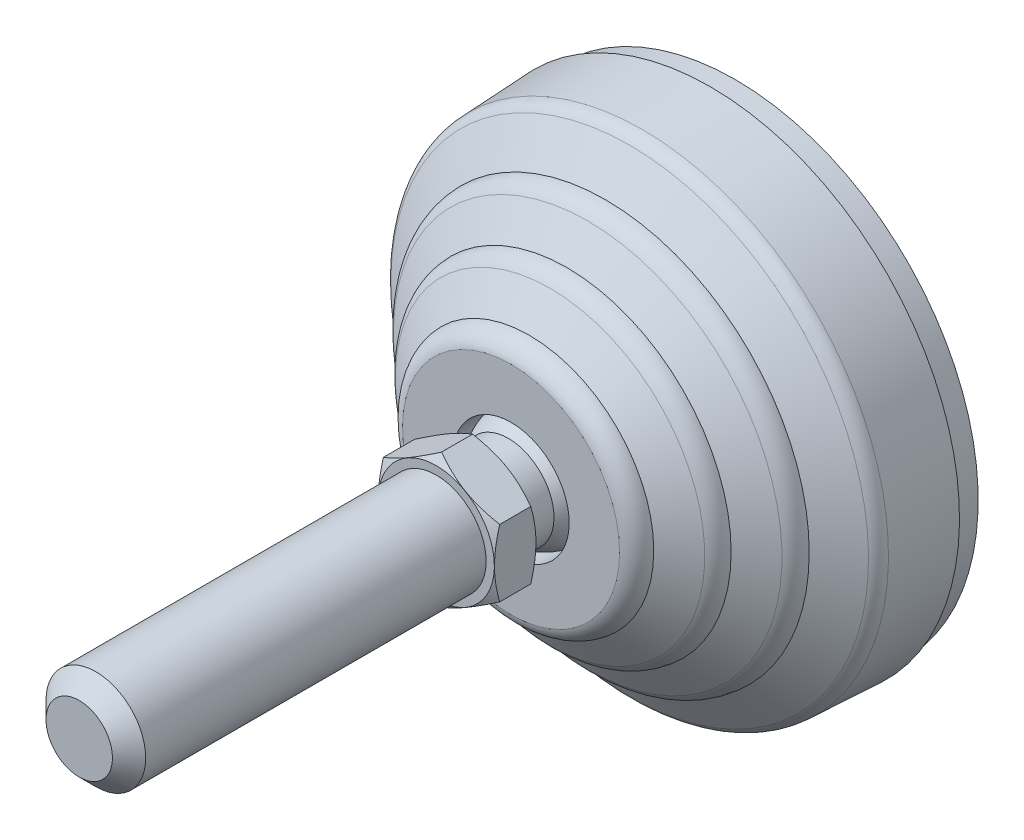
ISO-10303-21;
HEADER;
FILE_DESCRIPTION(('STEP AP214'),'2;1');
FILE_NAME('part.step','',(''),(''),'','','');
FILE_SCHEMA(('AUTOMOTIVE_DESIGN { 1 0 10303 214 1 1 1 1 }'));
ENDSEC;
DATA;
#1=APPLICATION_CONTEXT('core data for automotive mechanical design processes');
#2=APPLICATION_PROTOCOL_DEFINITION('international standard','automotive_design',2000,#1);
#3=PRODUCT_CONTEXT('',#1,'mechanical');
#4=PRODUCT('Part','Part','',(#3));
#5=PRODUCT_RELATED_PRODUCT_CATEGORY('part','',(#4));
#6=PRODUCT_DEFINITION_FORMATION('','',#4);
#7=PRODUCT_DEFINITION_CONTEXT('part definition',#1,'design');
#8=PRODUCT_DEFINITION('design','',#6,#7);
#9=PRODUCT_DEFINITION_SHAPE('','',#8);
#10=(LENGTH_UNIT() NAMED_UNIT(*) SI_UNIT(.MILLI.,.METRE.));
#11=(NAMED_UNIT(*) PLANE_ANGLE_UNIT() SI_UNIT($,.RADIAN.));
#12=(NAMED_UNIT(*) SI_UNIT($,.STERADIAN.) SOLID_ANGLE_UNIT());
#13=UNCERTAINTY_MEASURE_WITH_UNIT(LENGTH_MEASURE(1.E-05),#10,'distance_accuracy_value','');
#14=(GEOMETRIC_REPRESENTATION_CONTEXT(3) GLOBAL_UNCERTAINTY_ASSIGNED_CONTEXT((#13)) GLOBAL_UNIT_ASSIGNED_CONTEXT((#10,
#11,#12)) REPRESENTATION_CONTEXT('',''));
#15=CARTESIAN_POINT('',(0.,0.,0.));
#16=DIRECTION('',(0.,0.,1.));
#17=DIRECTION('',(1.,0.,0.));
#18=AXIS2_PLACEMENT_3D('',#15,#16,#17);
#19=CARTESIAN_POINT('',(0.,0.,35.));
#20=DIRECTION('',(0.,0.,-1.));
#21=DIRECTION('',(0.,1.,0.));
#22=AXIS2_PLACEMENT_3D('',#19,#20,#21);
#23=CYLINDRICAL_SURFACE('',#22,7.);
#24=CARTESIAN_POINT('',(-7.,0.,23.));
#25=CARTESIAN_POINT('',(-7.00000242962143,-0.114537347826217,23.));
#26=CARTESIAN_POINT('',(-6.99718891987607,-0.229074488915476,23.));
#27=CARTESIAN_POINT('',(-6.98594746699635,-0.45787295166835,23.));
#28=CARTESIAN_POINT('',(-6.97751952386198,-0.572134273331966,23.));
#29=CARTESIAN_POINT('',(-6.95506664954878,-0.800105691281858,23.));
#30=CARTESIAN_POINT('',(-6.94104171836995,-0.913815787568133,23.));
#31=CARTESIAN_POINT('',(-6.90742942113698,-1.14041085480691,23.));
#32=CARTESIAN_POINT('',(-6.88784205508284,-1.25329582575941,23.));
#33=CARTESIAN_POINT('',(-6.84315187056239,-1.47796868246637,23.));
#34=CARTESIAN_POINT('',(-6.81804905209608,-1.58975656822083,23.));
#35=CARTESIAN_POINT('',(-6.76238849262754,-1.81196595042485,23.));
#36=CARTESIAN_POINT('',(-6.73183075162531,-1.9223874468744,23.));
#37=CARTESIAN_POINT('',(-6.66533394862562,-2.14159803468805,23.));
#38=CARTESIAN_POINT('',(-6.62939488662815,-2.25038712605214,23.));
#39=CARTESIAN_POINT('',(-6.55222202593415,-2.46607082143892,23.));
#40=CARTESIAN_POINT('',(-6.51098822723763,-2.5729654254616,23.));
#41=CARTESIAN_POINT('',(-6.42332522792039,-2.78460262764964,23.));
#42=CARTESIAN_POINT('',(-6.37689602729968,-2.88934522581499,23.));
#43=CARTESIAN_POINT('',(-6.27895407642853,-3.09642608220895,23.));
#44=CARTESIAN_POINT('',(-6.22744132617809,-3.19876434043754,23.));
#45=CARTESIAN_POINT('',(-6.11945637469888,-3.40078997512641,23.));
#46=CARTESIAN_POINT('',(-6.06298417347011,-3.50047735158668,23.));
#47=CARTESIAN_POINT('',(-5.94521636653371,-3.69696106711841,23.));
#48=CARTESIAN_POINT('',(-5.88392076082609,-3.79375740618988,23.));
#49=CARTESIAN_POINT('',(-5.75665381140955,-3.98422585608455,23.));
#50=CARTESIAN_POINT('',(-5.69068246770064,-4.07789796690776,23.));
#51=CARTESIAN_POINT('',(-5.55422297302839,-4.26189229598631,23.));
#52=CARTESIAN_POINT('',(-5.48373482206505,-4.35221451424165,23.));
#53=CARTESIAN_POINT('',(-5.33841152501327,-4.52929146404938,23.));
#54=CARTESIAN_POINT('',(-5.26357637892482,-4.61604619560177,23.));
#55=CARTESIAN_POINT('',(-5.10973937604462,-4.78577917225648,23.));
#56=CARTESIAN_POINT('',(-5.03073751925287,-4.8687574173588,23.));
#57=CARTESIAN_POINT('',(-4.8687574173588,-5.03073751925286,23.));
#58=CARTESIAN_POINT('',(-4.78577917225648,-5.10973937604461,23.));
#59=CARTESIAN_POINT('',(-4.61604619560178,-5.26357637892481,23.));
#60=CARTESIAN_POINT('',(-4.52929146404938,-5.33841152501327,23.));
#61=CARTESIAN_POINT('',(-4.35221451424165,-5.48373482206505,23.));
#62=CARTESIAN_POINT('',(-4.26189229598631,-5.55422297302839,23.));
#63=CARTESIAN_POINT('',(-4.07789796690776,-5.69068246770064,23.));
#64=CARTESIAN_POINT('',(-3.98422585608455,-5.75665381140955,23.));
#65=CARTESIAN_POINT('',(-3.79375740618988,-5.88392076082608,23.));
#66=CARTESIAN_POINT('',(-3.69696106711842,-5.9452163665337,23.));
#67=CARTESIAN_POINT('',(-3.50047735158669,-6.0629841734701,23.));
#68=CARTESIAN_POINT('',(-3.40078997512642,-6.11945637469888,23.));
#69=CARTESIAN_POINT('',(-3.19876434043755,-6.22744132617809,23.));
#70=CARTESIAN_POINT('',(-3.09642608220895,-6.27895407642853,23.));
#71=CARTESIAN_POINT('',(-2.88934522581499,-6.37689602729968,23.));
#72=CARTESIAN_POINT('',(-2.78460262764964,-6.42332522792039,23.));
#73=CARTESIAN_POINT('',(-2.57296542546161,-6.51098822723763,23.));
#74=CARTESIAN_POINT('',(-2.46607082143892,-6.55222202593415,23.));
#75=CARTESIAN_POINT('',(-2.25038712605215,-6.62939488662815,23.));
#76=CARTESIAN_POINT('',(-2.14159803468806,-6.66533394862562,23.));
#77=CARTESIAN_POINT('',(-1.92238744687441,-6.73183075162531,23.));
#78=CARTESIAN_POINT('',(-1.81196595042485,-6.76238849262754,23.));
#79=CARTESIAN_POINT('',(-1.58975656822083,-6.81804905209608,23.));
#80=CARTESIAN_POINT('',(-1.47796868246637,-6.84315187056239,23.));
#81=CARTESIAN_POINT('',(-1.25329582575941,-6.88784205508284,23.));
#82=CARTESIAN_POINT('',(-1.14041085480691,-6.90742942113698,23.));
#83=CARTESIAN_POINT('',(-0.913815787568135,-6.94104171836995,23.));
#84=CARTESIAN_POINT('',(-0.80010569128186,-6.95506664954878,23.));
#85=CARTESIAN_POINT('',(-0.572134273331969,-6.97751952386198,23.));
#86=CARTESIAN_POINT('',(-0.457872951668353,-6.98594746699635,23.));
#87=CARTESIAN_POINT('',(-0.229074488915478,-6.99718891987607,23.));
#88=CARTESIAN_POINT('',(-0.11453734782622,-7.00000242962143,23.));
#89=CARTESIAN_POINT('',(0.,-7.,23.));
#90=B_SPLINE_CURVE_WITH_KNOTS('',3,(#24,#25,#26,#27,#28,#29,#30,#31,#32,#33,#34,#35,#36,#37,#38,
#39,#40,#41,#42,#43,#44,#45,#46,#47,#48,#49,#50,#51,#52,#53,#54,#55,#56,#57,#58,#59,#60,#61,#62,
#63,#64,#65,#66,#67,#68,#69,#70,#71,#72,#73,#74,#75,#76,#77,#78,#79,#80,#81,#82,#83,#84,#85,#86,
#87,#88,#89),.UNSPECIFIED.,.F.,.F.,(4,2,2,2,2,2,2,2,2,2,2,2,2,2,2,2,2,2,2,2,2,2,2,2,2,2,2,2,2,2,
2,2,4),(0.,0.343577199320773,0.687154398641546,1.03073159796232,1.37430879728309,
1.71788599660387,2.06146319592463,2.40504039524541,2.74861759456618,3.09219479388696,
3.43577199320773,3.7793491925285,4.12292639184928,4.46650359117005,4.81008079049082,
5.15365798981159,5.49723518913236,5.84081238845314,6.18438958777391,6.52796678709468,
6.87154398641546,7.21512118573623,7.558698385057,7.90227558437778,8.24585278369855,
8.58942998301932,8.93300718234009,9.27658438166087,9.62016158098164,9.96373878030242,
10.3073159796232,10.650893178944,10.9944703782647),.UNSPECIFIED.);
#91=CARTESIAN_POINT('',(-7.,0.,23.0001794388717));
#92=VERTEX_POINT('',#91);
#93=CARTESIAN_POINT('',(0.,-7.,23.));
#94=VERTEX_POINT('',#93);
#95=EDGE_CURVE('E138',#92,#94,#90,.T.);
#96=ORIENTED_EDGE('',*,*,#95,.F.);
#97=CARTESIAN_POINT('',(0.,0.,23.));
#98=DIRECTION('',(0.,0.,-1.));
#99=DIRECTION('',(0.,1.,0.));
#100=AXIS2_PLACEMENT_3D('',#97,#98,#99);
#101=CIRCLE('',#100,7.);
#102=CARTESIAN_POINT('',(0.,7.,23.));
#103=VERTEX_POINT('',#102);
#104=EDGE_CURVE('E134',#103,#92,#101,.F.);
#105=ORIENTED_EDGE('',*,*,#104,.F.);
#106=CARTESIAN_POINT('',(7.,0.,23.));
#107=CARTESIAN_POINT('',(7.00000242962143,0.114537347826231,22.9999999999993));
#108=CARTESIAN_POINT('',(6.99718891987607,0.22907448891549,22.9999999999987));
#109=CARTESIAN_POINT('',(6.98594746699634,0.457872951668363,22.9999999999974));
#110=CARTESIAN_POINT('',(6.97751952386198,0.572134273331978,22.9999999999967));
#111=CARTESIAN_POINT('',(6.95506664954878,0.800105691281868,22.9999999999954));
#112=CARTESIAN_POINT('',(6.94104171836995,0.913815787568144,22.9999999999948));
#113=CARTESIAN_POINT('',(6.90742942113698,1.14041085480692,22.9999999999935));
#114=CARTESIAN_POINT('',(6.88784205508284,1.25329582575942,22.9999999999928));
#115=CARTESIAN_POINT('',(6.84315187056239,1.47796868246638,22.9999999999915));
#116=CARTESIAN_POINT('',(6.81804905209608,1.58975656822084,22.9999999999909));
#117=CARTESIAN_POINT('',(6.76238849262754,1.81196595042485,22.9999999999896));
#118=CARTESIAN_POINT('',(6.73183075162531,1.92238744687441,22.999999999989));
#119=CARTESIAN_POINT('',(6.66533394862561,2.14159803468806,22.9999999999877));
#120=CARTESIAN_POINT('',(6.62939488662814,2.25038712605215,22.9999999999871));
#121=CARTESIAN_POINT('',(6.55222202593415,2.46607082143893,22.9999999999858));
#122=CARTESIAN_POINT('',(6.51098822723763,2.57296542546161,22.9999999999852));
#123=CARTESIAN_POINT('',(6.42332522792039,2.78460262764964,22.999999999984));
#124=CARTESIAN_POINT('',(6.37689602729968,2.88934522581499,22.9999999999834));
#125=CARTESIAN_POINT('',(6.27895407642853,3.09642608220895,22.9999999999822));
#126=CARTESIAN_POINT('',(6.22744132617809,3.19876434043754,22.9999999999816));
#127=CARTESIAN_POINT('',(6.11945637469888,3.40078997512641,22.9999999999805));
#128=CARTESIAN_POINT('',(6.06298417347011,3.50047735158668,22.9999999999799));
#129=CARTESIAN_POINT('',(5.94521636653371,3.69696106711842,22.9999999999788));
#130=CARTESIAN_POINT('',(5.88392076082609,3.79375740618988,22.9999999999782));
#131=CARTESIAN_POINT('',(5.75665381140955,3.98422585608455,22.9999999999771));
#132=CARTESIAN_POINT('',(5.69068246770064,4.07789796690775,22.9999999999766));
#133=CARTESIAN_POINT('',(5.55422297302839,4.26189229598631,22.9999999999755));
#134=CARTESIAN_POINT('',(5.48373482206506,4.35221451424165,22.999999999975));
#135=CARTESIAN_POINT('',(5.33841152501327,4.52929146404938,22.999999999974));
#136=CARTESIAN_POINT('',(5.26357637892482,4.61604619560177,22.9999999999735));
#137=CARTESIAN_POINT('',(5.10973937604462,4.78577917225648,22.9999999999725));
#138=CARTESIAN_POINT('',(5.03073751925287,4.8687574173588,22.9999999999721));
#139=CARTESIAN_POINT('',(4.8687574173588,5.03073751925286,22.9999999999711));
#140=CARTESIAN_POINT('',(4.78577917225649,5.10973937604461,22.9999999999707));
#141=CARTESIAN_POINT('',(4.61604619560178,5.26357637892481,22.9999999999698));
#142=CARTESIAN_POINT('',(4.52929146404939,5.33841152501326,22.9999999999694));
#143=CARTESIAN_POINT('',(4.35221451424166,5.48373482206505,22.9999999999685));
#144=CARTESIAN_POINT('',(4.26189229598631,5.55422297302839,22.9999999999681));
#145=CARTESIAN_POINT('',(4.07789796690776,5.69068246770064,22.9999999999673));
#146=CARTESIAN_POINT('',(3.98422585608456,5.75665381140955,22.999999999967));
#147=CARTESIAN_POINT('',(3.79375740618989,5.88392076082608,22.9999999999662));
#148=CARTESIAN_POINT('',(3.69696106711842,5.9452163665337,22.9999999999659));
#149=CARTESIAN_POINT('',(3.50047735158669,6.0629841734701,22.9999999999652));
#150=CARTESIAN_POINT('',(3.40078997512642,6.11945637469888,22.9999999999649));
#151=CARTESIAN_POINT('',(3.19876434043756,6.22744132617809,22.9999999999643));
#152=CARTESIAN_POINT('',(3.09642608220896,6.27895407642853,22.999999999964));
#153=CARTESIAN_POINT('',(2.88934522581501,6.37689602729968,22.9999999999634));
#154=CARTESIAN_POINT('',(2.78460262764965,6.42332522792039,22.9999999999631));
#155=CARTESIAN_POINT('',(2.57296542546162,6.51098822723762,22.9999999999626));
#156=CARTESIAN_POINT('',(2.46607082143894,6.55222202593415,22.9999999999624));
#157=CARTESIAN_POINT('',(2.25038712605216,6.62939488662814,22.999999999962));
#158=CARTESIAN_POINT('',(2.14159803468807,6.66533394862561,22.9999999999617));
#159=CARTESIAN_POINT('',(1.92238744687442,6.73183075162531,22.9999999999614));
#160=CARTESIAN_POINT('',(1.81196595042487,6.76238849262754,22.9999999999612));
#161=CARTESIAN_POINT('',(1.58975656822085,6.81804905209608,22.9999999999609));
#162=CARTESIAN_POINT('',(1.47796868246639,6.84315187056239,22.9999999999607));
#163=CARTESIAN_POINT('',(1.25329582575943,6.88784205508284,22.9999999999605));
#164=CARTESIAN_POINT('',(1.14041085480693,6.90742942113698,22.9999999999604));
#165=CARTESIAN_POINT('',(0.913815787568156,6.94104171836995,22.9999999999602));
#166=CARTESIAN_POINT('',(0.80010569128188,6.95506664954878,22.9999999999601));
#167=CARTESIAN_POINT('',(0.572134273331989,6.97751952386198,22.9999999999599));
#168=CARTESIAN_POINT('',(0.457872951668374,6.98594746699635,22.9999999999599));
#169=CARTESIAN_POINT('',(0.229074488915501,6.99718891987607,22.9999999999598));
#170=CARTESIAN_POINT('',(0.114537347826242,7.00000242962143,22.9999999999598));
#171=CARTESIAN_POINT('',(0.,7.,22.9999999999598));
#172=B_SPLINE_CURVE_WITH_KNOTS('',3,(#106,#107,#108,#109,#110,#111,#112,#113,#114,#115,#116,
#117,#118,#119,#120,#121,#122,#123,#124,#125,#126,#127,#128,#129,#130,#131,#132,#133,#134,#135,
#136,#137,#138,#139,#140,#141,#142,#143,#144,#145,#146,#147,#148,#149,#150,#151,#152,#153,#154,
#155,#156,#157,#158,#159,#160,#161,#162,#163,#164,#165,#166,#167,#168,#169,#170,#171),
.UNSPECIFIED.,.F.,.F.,(4,2,2,2,2,2,2,2,2,2,2,2,2,2,2,2,2,2,2,2,2,2,2,2,2,2,2,2,2,2,2,2,4),(0.,
0.343577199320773,0.687154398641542,1.03073159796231,1.37430879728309,1.71788599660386,
2.06146319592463,2.4050403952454,2.74861759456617,3.09219479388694,3.43577199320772,
3.77934919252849,4.12292639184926,4.46650359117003,4.8100807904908,5.15365798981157,
5.49723518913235,5.84081238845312,6.18438958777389,6.52796678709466,6.87154398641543,
7.21512118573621,7.55869838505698,7.90227558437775,8.24585278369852,8.58942998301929,
8.93300718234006,9.27658438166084,9.62016158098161,9.96373878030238,10.3073159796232,
10.6508931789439,10.9944703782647),.UNSPECIFIED.);
#173=CARTESIAN_POINT('',(7.,0.,23.));
#174=VERTEX_POINT('',#173);
#175=EDGE_CURVE('E31',#174,#103,#172,.T.);
#176=ORIENTED_EDGE('',*,*,#175,.F.);
#177=CARTESIAN_POINT('',(0.,0.,23.));
#178=DIRECTION('',(0.,0.,-1.));
#179=DIRECTION('',(0.,1.,0.));
#180=AXIS2_PLACEMENT_3D('',#177,#178,#179);
#181=CIRCLE('',#180,7.);
#182=EDGE_CURVE('E135',#94,#174,#181,.F.);
#183=ORIENTED_EDGE('',*,*,#182,.F.);
#184=EDGE_LOOP('',(#96,#105,#176,#183));
#185=FACE_BOUND('',#184,.T.);
#186=CARTESIAN_POINT('',(0.,0.,27.));
#187=DIRECTION('',(0.,0.,-1.));
#188=DIRECTION('',(0.,1.,0.));
#189=AXIS2_PLACEMENT_3D('',#186,#187,#188);
#190=CIRCLE('',#189,7.);
#191=CARTESIAN_POINT('',(0.,7.,27.));
#192=VERTEX_POINT('',#191);
#193=EDGE_CURVE('E161',#192,#192,#190,.T.);
#194=ORIENTED_EDGE('',*,*,#193,.F.);
#195=EDGE_LOOP('',(#194));
#196=FACE_BOUND('',#195,.T.);
#197=ADVANCED_FACE('F14',(#185,#196),#23,.F.);
#198=CARTESIAN_POINT('',(-6.53226682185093,0.,27.));
#199=DIRECTION('',(0.,0.,1.));
#200=DIRECTION('',(-1.,0.,0.));
#201=AXIS2_PLACEMENT_3D('',#198,#199,#200);
#202=PLANE('',#201);
#203=CARTESIAN_POINT('',(0.,0.,27.));
#204=DIRECTION('',(0.,0.,-1.));
#205=DIRECTION('',(0.,1.,0.));
#206=AXIS2_PLACEMENT_3D('',#203,#204,#205);
#207=CIRCLE('',#206,13.0645336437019);
#208=CARTESIAN_POINT('',(0.,13.0645336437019,27.));
#209=VERTEX_POINT('',#208);
#210=EDGE_CURVE('E157',#209,#209,#207,.T.);
#211=ORIENTED_EDGE('',*,*,#210,.F.);
#212=EDGE_LOOP('',(#211));
#213=FACE_BOUND('',#212,.T.);
#214=ORIENTED_EDGE('',*,*,#193,.T.);
#215=EDGE_LOOP('',(#214));
#216=FACE_BOUND('',#215,.T.);
#217=ADVANCED_FACE('F311',(#213,#216),#202,.T.);
#218=CARTESIAN_POINT('',(0.,0.,24.5842));
#219=DIRECTION('',(0.,0.,-1.));
#220=DIRECTION('',(0.,1.,0.));
#221=AXIS2_PLACEMENT_3D('',#218,#219,#220);
#222=TOROIDAL_SURFACE('',#221,12.5253,2.47525);
#223=ORIENTED_EDGE('',*,*,#210,.T.);
#224=EDGE_LOOP('',(#223));
#225=FACE_BOUND('',#224,.T.);
#226=CARTESIAN_POINT('',(0.,0.,24.8062186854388));
#227=DIRECTION('',(0.,0.,-1.));
#228=DIRECTION('',(-1.,0.,0.));
#229=AXIS2_PLACEMENT_3D('',#226,#227,#228);
#230=CIRCLE('',#229,14.9905728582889);
#231=CARTESIAN_POINT('',(-14.9905728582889,0.,24.8062186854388));
#232=VERTEX_POINT('',#231);
#233=EDGE_CURVE('E160',#232,#232,#230,.T.);
#234=ORIENTED_EDGE('',*,*,#233,.F.);
#235=EDGE_LOOP('',(#234));
#236=FACE_BOUND('',#235,.T.);
#237=ADVANCED_FACE('F499',(#225,#236),#222,.T.);
#238=CARTESIAN_POINT('',(0.,0.,22.3004110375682));
#239=DIRECTION('',(0.,0.,-1.));
#240=DIRECTION('',(0.,1.,0.));
#241=AXIS2_PLACEMENT_3D('',#238,#239,#240);
#242=CONICAL_SURFACE('',#241,18.63040749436,0.967870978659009);
#243=ORIENTED_EDGE('',*,*,#233,.T.);
#244=EDGE_LOOP('',(#243));
#245=FACE_BOUND('',#244,.T.);
#246=CARTESIAN_POINT('',(0.,0.,22.3004110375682));
#247=DIRECTION('',(0.,0.,-1.));
#248=DIRECTION('',(0.,1.,0.));
#249=AXIS2_PLACEMENT_3D('',#246,#247,#248);
#250=CIRCLE('',#249,18.63040749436);
#251=CARTESIAN_POINT('',(0.,18.63040749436,22.3004110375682));
#252=VERTEX_POINT('',#251);
#253=EDGE_CURVE('E556',#252,#252,#250,.T.);
#254=ORIENTED_EDGE('',*,*,#253,.F.);
#255=EDGE_LOOP('',(#254));
#256=FACE_BOUND('',#255,.T.);
#257=ADVANCED_FACE('F489',(#245,#256),#242,.T.);
#258=CARTESIAN_POINT('',(0.,0.,20.149417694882));
#259=DIRECTION('',(0.,0.,-1.));
#260=DIRECTION('',(0.,1.,0.));
#261=AXIS2_PLACEMENT_3D('',#258,#259,#260);
#262=TOROIDAL_SURFACE('',#261,17.1699621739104,2.59993709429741);
#263=CARTESIAN_POINT('',(0.,0.,20.266146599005));
#264=DIRECTION('',(0.,0.,-1.));
#265=DIRECTION('',(-1.,0.,0.));
#266=AXIS2_PLACEMENT_3D('',#263,#264,#265);
#267=CIRCLE('',#266,19.7672775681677);
#268=CARTESIAN_POINT('',(-19.7672775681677,0.,20.266146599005));
#269=VERTEX_POINT('',#268);
#270=EDGE_CURVE('E559',#269,#269,#267,.T.);
#271=ORIENTED_EDGE('',*,*,#270,.F.);
#272=EDGE_LOOP('',(#271));
#273=FACE_BOUND('',#272,.T.);
#274=ORIENTED_EDGE('',*,*,#253,.T.);
#275=EDGE_LOOP('',(#274));
#276=FACE_BOUND('',#275,.T.);
#277=ADVANCED_FACE('F479',(#273,#276),#262,.T.);
#278=CARTESIAN_POINT('',(0.,0.,17.7704000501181));
#279=DIRECTION('',(0.,0.,-1.));
#280=DIRECTION('',(0.,1.,0.));
#281=AXIS2_PLACEMENT_3D('',#278,#279,#280);
#282=CONICAL_SURFACE('',#281,23.3925000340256,0.967871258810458);
#283=CARTESIAN_POINT('',(0.,0.,17.7704000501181));
#284=DIRECTION('',(0.,0.,-1.));
#285=DIRECTION('',(0.,1.,0.));
#286=AXIS2_PLACEMENT_3D('',#283,#284,#285);
#287=CIRCLE('',#286,23.3925000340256);
#288=CARTESIAN_POINT('',(0.,23.3925000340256,17.7704000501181));
#289=VERTEX_POINT('',#288);
#290=EDGE_CURVE('E567',#289,#289,#287,.T.);
#291=ORIENTED_EDGE('',*,*,#290,.F.);
#292=EDGE_LOOP('',(#291));
#293=FACE_BOUND('',#292,.T.);
#294=ORIENTED_EDGE('',*,*,#270,.T.);
#295=EDGE_LOOP('',(#294));
#296=FACE_BOUND('',#295,.T.);
#297=ADVANCED_FACE('F469',(#293,#296),#282,.T.);
#298=CARTESIAN_POINT('',(0.,0.,15.6193000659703));
#299=DIRECTION('',(0.,0.,-1.));
#300=DIRECTION('',(0.,1.,0.));
#301=AXIS2_PLACEMENT_3D('',#298,#299,#300);
#302=TOROIDAL_SURFACE('',#301,21.9321002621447,2.59999973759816);
#303=ORIENTED_EDGE('',*,*,#290,.T.);
#304=EDGE_LOOP('',(#303));
#305=FACE_BOUND('',#304,.T.);
#306=CARTESIAN_POINT('',(0.,0.,15.6295138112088));
#307=DIRECTION('',(0.,0.,-1.));
#308=DIRECTION('',(-1.,0.,0.));
#309=AXIS2_PLACEMENT_3D('',#306,#307,#308);
#310=CIRCLE('',#309,24.5320799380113);
#311=CARTESIAN_POINT('',(-24.5320799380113,0.,15.6295138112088));
#312=VERTEX_POINT('',#311);
#313=EDGE_CURVE('E573',#312,#312,#310,.T.);
#314=ORIENTED_EDGE('',*,*,#313,.F.);
#315=EDGE_LOOP('',(#314));
#316=FACE_BOUND('',#315,.T.);
#317=ADVANCED_FACE('F459',(#305,#316),#302,.T.);
#318=CARTESIAN_POINT('',(0.,0.,12.7183562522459));
#319=DIRECTION('',(0.,0.,-1.));
#320=DIRECTION('',(0.,1.,0.));
#321=AXIS2_PLACEMENT_3D('',#318,#319,#320);
#322=CONICAL_SURFACE('',#321,28.760790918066,0.967879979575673);
#323=ORIENTED_EDGE('',*,*,#313,.T.);
#324=EDGE_LOOP('',(#323));
#325=FACE_BOUND('',#324,.T.);
#326=CARTESIAN_POINT('',(0.,0.,12.7183562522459));
#327=DIRECTION('',(0.,0.,-1.));
#328=DIRECTION('',(0.,1.,0.));
#329=AXIS2_PLACEMENT_3D('',#326,#327,#328);
#330=CIRCLE('',#329,28.760790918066);
#331=CARTESIAN_POINT('',(0.,28.760790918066,12.7183562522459));
#332=VERTEX_POINT('',#331);
#333=EDGE_CURVE('E576',#332,#332,#330,.T.);
#334=ORIENTED_EDGE('',*,*,#333,.F.);
#335=EDGE_LOOP('',(#334));
#336=FACE_BOUND('',#335,.T.);
#337=ADVANCED_FACE('F449',(#325,#336),#322,.T.);
#338=CARTESIAN_POINT('',(0.,0.,11.0710969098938));
#339=DIRECTION('',(0.,0.,-1.));
#340=DIRECTION('',(0.,1.,0.));
#341=AXIS2_PLACEMENT_3D('',#338,#339,#340);
#342=TOROIDAL_SURFACE('',#341,27.6268354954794,1.9998295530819);
#343=CARTESIAN_POINT('',(0.,0.,11.1756615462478));
#344=DIRECTION('',(0.,0.,-1.));
#345=DIRECTION('',(-1.,0.,0.));
#346=AXIS2_PLACEMENT_3D('',#343,#344,#345);
#347=CIRCLE('',#346,29.6239295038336);
#348=CARTESIAN_POINT('',(-29.6239295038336,0.,11.1756615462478));
#349=VERTEX_POINT('',#348);
#350=EDGE_CURVE('E156',#349,#349,#347,.T.);
#351=ORIENTED_EDGE('',*,*,#350,.F.);
#352=EDGE_LOOP('',(#351));
#353=FACE_BOUND('',#352,.T.);
#354=ORIENTED_EDGE('',*,*,#333,.T.);
#355=EDGE_LOOP('',(#354));
#356=FACE_BOUND('',#355,.T.);
#357=ADVANCED_FACE('F439',(#353,#356),#342,.T.);
#358=CARTESIAN_POINT('',(0.,0.,3.00000000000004));
#359=DIRECTION('',(0.,0.,-1.));
#360=DIRECTION('',(0.,1.,0.));
#361=AXIS2_PLACEMENT_3D('',#358,#359,#360);
#362=CONICAL_SURFACE('',#361,30.,0.0459663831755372);
#363=CARTESIAN_POINT('',(0.,0.,3.));
#364=DIRECTION('',(0.,0.,-1.));
#365=DIRECTION('',(0.,1.,0.));
#366=AXIS2_PLACEMENT_3D('',#363,#364,#365);
#367=CIRCLE('',#366,30.);
#368=CARTESIAN_POINT('',(0.,30.,3.));
#369=VERTEX_POINT('',#368);
#370=EDGE_CURVE('E153',#369,#369,#367,.T.);
#371=ORIENTED_EDGE('',*,*,#370,.F.);
#372=EDGE_LOOP('',(#371));
#373=FACE_BOUND('',#372,.T.);
#374=ORIENTED_EDGE('',*,*,#350,.T.);
#375=EDGE_LOOP('',(#374));
#376=FACE_BOUND('',#375,.T.);
#377=ADVANCED_FACE('F429',(#373,#376),#362,.T.);
#378=CARTESIAN_POINT('',(-29.625,0.,3.));
#379=DIRECTION('',(0.,0.,-1.));
#380=DIRECTION('',(0.,1.,0.));
#381=AXIS2_PLACEMENT_3D('',#378,#379,#380);
#382=PLANE('',#381);
#383=ORIENTED_EDGE('',*,*,#370,.T.);
#384=EDGE_LOOP('',(#383));
#385=FACE_BOUND('',#384,.T.);
#386=CARTESIAN_POINT('',(0.,0.,3.));
#387=DIRECTION('',(0.,0.,1.));
#388=DIRECTION('',(0.,-1.,0.));
#389=AXIS2_PLACEMENT_3D('',#386,#387,#388);
#390=CIRCLE('',#389,29.25);
#391=CARTESIAN_POINT('',(0.,-29.25,3.));
#392=VERTEX_POINT('',#391);
#393=EDGE_CURVE('E150',#392,#392,#390,.F.);
#394=ORIENTED_EDGE('',*,*,#393,.F.);
#395=EDGE_LOOP('',(#394));
#396=FACE_BOUND('',#395,.T.);
#397=ADVANCED_FACE('F418',(#385,#396),#382,.T.);
#398=CARTESIAN_POINT('',(0.,0.,1.5));
#399=DIRECTION('',(0.,0.,1.));
#400=DIRECTION('',(0.,-1.,0.));
#401=AXIS2_PLACEMENT_3D('',#398,#399,#400);
#402=CYLINDRICAL_SURFACE('',#401,29.25);
#403=CARTESIAN_POINT('',(0.,0.,0.));
#404=DIRECTION('',(0.,0.,1.));
#405=DIRECTION('',(0.,-1.,0.));
#406=AXIS2_PLACEMENT_3D('',#403,#404,#405);
#407=CIRCLE('',#406,29.25);
#408=CARTESIAN_POINT('',(0.,-29.25,0.));
#409=VERTEX_POINT('',#408);
#410=EDGE_CURVE('E147',#409,#409,#407,.F.);
#411=ORIENTED_EDGE('',*,*,#410,.F.);
#412=EDGE_LOOP('',(#411));
#413=FACE_BOUND('',#412,.T.);
#414=ORIENTED_EDGE('',*,*,#393,.T.);
#415=EDGE_LOOP('',(#414));
#416=FACE_BOUND('',#415,.T.);
#417=ADVANCED_FACE('F303',(#413,#416),#402,.T.);
#418=CARTESIAN_POINT('',(-14.625,0.,0.));
#419=DIRECTION('',(0.,0.,-1.));
#420=DIRECTION('',(0.,1.,0.));
#421=AXIS2_PLACEMENT_3D('',#418,#419,#420);
#422=PLANE('',#421);
#423=ORIENTED_EDGE('',*,*,#410,.T.);
#424=EDGE_LOOP('',(#423));
#425=FACE_BOUND('',#424,.T.);
#426=ADVANCED_FACE('F117',(#425),#422,.T.);
#427=CARTESIAN_POINT('',(0.,0.,56.4265));
#428=DIRECTION('',(0.,0.,-1.));
#429=DIRECTION('',(0.,1.,0.));
#430=AXIS2_PLACEMENT_3D('',#427,#428,#429);
#431=CYLINDRICAL_SURFACE('',#430,6.);
#432=CARTESIAN_POINT('',(0.,0.,77.));
#433=DIRECTION('',(0.,0.,1.));
#434=DIRECTION('',(0.,-1.,0.));
#435=AXIS2_PLACEMENT_3D('',#432,#433,#434);
#436=CIRCLE('',#435,6.);
#437=CARTESIAN_POINT('',(0.,-6.,77.));
#438=VERTEX_POINT('',#437);
#439=EDGE_CURVE('E9',#438,#438,#436,.F.);
#440=ORIENTED_EDGE('',*,*,#439,.T.);
#441=EDGE_LOOP('',(#440));
#442=FACE_BOUND('',#441,.T.);
#443=CARTESIAN_POINT('',(0.,0.,36.));
#444=DIRECTION('',(0.,0.,-1.));
#445=DIRECTION('',(0.,1.,0.));
#446=AXIS2_PLACEMENT_3D('',#443,#444,#445);
#447=CIRCLE('',#446,6.);
#448=CARTESIAN_POINT('',(0.,6.,36.));
#449=VERTEX_POINT('',#448);
#450=EDGE_CURVE('E136',#449,#449,#447,.F.);
#451=ORIENTED_EDGE('',*,*,#450,.T.);
#452=EDGE_LOOP('',(#451));
#453=FACE_BOUND('',#452,.T.);
#454=ADVANCED_FACE('F293',(#442,#453),#431,.T.);
#455=CARTESIAN_POINT('',(6.495,0.,36.));
#456=DIRECTION('',(0.,0.,1.));
#457=DIRECTION('',(0.,-1.,0.));
#458=AXIS2_PLACEMENT_3D('',#455,#456,#457);
#459=PLANE('',#458);
#460=CARTESIAN_POINT('',(0.,0.,36.));
#461=DIRECTION('',(0.,0.,-1.));
#462=DIRECTION('',(0.,1.,0.));
#463=AXIS2_PLACEMENT_3D('',#460,#461,#462);
#464=CIRCLE('',#463,6.99);
#465=CARTESIAN_POINT('',(0.,6.99,36.));
#466=VERTEX_POINT('',#465);
#467=EDGE_CURVE('E607',#466,#466,#464,.F.);
#468=ORIENTED_EDGE('',*,*,#467,.T.);
#469=EDGE_LOOP('',(#468));
#470=FACE_BOUND('',#469,.T.);
#471=ORIENTED_EDGE('',*,*,#450,.F.);
#472=EDGE_LOOP('',(#471));
#473=FACE_BOUND('',#472,.T.);
#474=ADVANCED_FACE('F260',(#470,#473),#459,.T.);
#475=CARTESIAN_POINT('',(0.,0.,35.3652257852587));
#476=DIRECTION('',(0.,0.,-1.));
#477=DIRECTION('',(0.,1.,0.));
#478=AXIS2_PLACEMENT_3D('',#475,#476,#477);
#479=CONICAL_SURFACE('',#478,8.08946119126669,1.0471975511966);
#480=ORIENTED_EDGE('',*,*,#467,.F.);
#481=EDGE_LOOP('',(#480));
#482=FACE_BOUND('',#481,.T.);
#483=CARTESIAN_POINT('',(-2.30772558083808E-08,8.0829037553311,35.3690117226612));
#484=CARTESIAN_POINT('',(-0.153866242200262,7.99406905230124,35.4202905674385));
#485=CARTESIAN_POINT('',(-0.30830614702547,7.90490313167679,35.4692419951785));
#486=CARTESIAN_POINT('',(-0.618440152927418,7.72584717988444,35.5618490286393));
#487=CARTESIAN_POINT('',(-0.774134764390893,7.63595685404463,35.6055023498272));
#488=CARTESIAN_POINT('',(-1.24371128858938,7.3648467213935,35.7276582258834));
#489=CARTESIAN_POINT('',(-1.55944671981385,7.18255678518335,35.7971380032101));
#490=CARTESIAN_POINT('',(-2.03193900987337,6.90976323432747,35.878609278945));
#491=CARTESIAN_POINT('',(-2.18728424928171,6.82007461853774,35.9018177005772));
#492=CARTESIAN_POINT('',(-2.49867655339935,6.64029218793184,35.9407339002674));
#493=CARTESIAN_POINT('',(-2.65472355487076,6.55019840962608,35.9564423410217));
#494=CARTESIAN_POINT('',(-2.96708848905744,6.369854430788,35.9799582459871));
#495=CARTESIAN_POINT('',(-3.1234059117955,6.27960452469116,35.98777467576));
#496=CARTESIAN_POINT('',(-3.43617641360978,6.09902639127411,35.9953473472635));
#497=CARTESIAN_POINT('',(-3.59262948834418,6.00869816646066,35.9951038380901));
#498=CARTESIAN_POINT('',(-4.02123302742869,5.76124379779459,35.9833586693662));
#499=CARTESIAN_POINT('',(-4.29324310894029,5.60419870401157,35.9636515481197));
#500=CARTESIAN_POINT('',(-4.83545665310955,5.2911515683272,35.9011668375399));
#501=CARTESIAN_POINT('',(-5.10565820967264,5.13515062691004,35.8583679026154));
#502=CARTESIAN_POINT('',(-5.64896246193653,4.82147377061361,35.7513856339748));
#503=CARTESIAN_POINT('',(-5.92199662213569,4.66383742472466,35.6867491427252));
#504=CARTESIAN_POINT('',(-6.46399382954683,4.35091519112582,35.5400514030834));
#505=CARTESIAN_POINT('',(-6.73296381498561,4.19562529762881,35.4580246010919));
#506=CARTESIAN_POINT('',(-6.99999992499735,4.04145192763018,35.3690117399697));
#507=B_SPLINE_CURVE_WITH_KNOTS('',3,(#483,#484,#485,#486,#487,#488,#489,#490,#491,#492,#493,
#494,#495,#496,#497,#498,#499,#500,#501,#502,#503,#504,#505,#506),.UNSPECIFIED.,.F.,.F.,(4,2,2,
2,2,2,2,2,2,2,2,4),(0.,0.554720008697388,1.10967836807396,2.22190068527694,2.76439120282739,
3.30683377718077,3.8486594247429,4.39046832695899,5.33360242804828,6.27760984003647,
7.24255081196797,8.20559801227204),.UNSPECIFIED.);
#508=CARTESIAN_POINT('',(-1.15386261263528E-08,8.08290376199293,35.369011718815));
#509=VERTEX_POINT('',#508);
#510=CARTESIAN_POINT('',(-7.,4.04145190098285,35.3690117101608));
#511=VERTEX_POINT('',#510);
#512=EDGE_CURVE('E100',#509,#511,#507,.T.);
#513=ORIENTED_EDGE('',*,*,#512,.T.);
#514=CARTESIAN_POINT('',(-7.,4.04145191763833,35.3690117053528));
#515=CARTESIAN_POINT('',(-7.,3.70968878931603,35.4647934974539));
#516=CARTESIAN_POINT('',(-7.,3.37530112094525,35.5524844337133));
#517=CARTESIAN_POINT('',(-7.,2.70109388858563,35.7074672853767));
#518=CARTESIAN_POINT('',(-7.,2.36126392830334,35.7747135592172));
#519=CARTESIAN_POINT('',(-7.,1.68541720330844,35.882853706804));
#520=CARTESIAN_POINT('',(-7.,1.34949559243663,35.9243241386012));
#521=CARTESIAN_POINT('',(-7.,0.675714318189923,35.9799957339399));
#522=CARTESIAN_POINT('',(-7.,0.337857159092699,35.9942264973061));
#523=CARTESIAN_POINT('',(-7.,-0.337857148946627,35.9942264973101));
#524=CARTESIAN_POINT('',(-7.,-0.67571429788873,35.9799957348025));
#525=CARTESIAN_POINT('',(-7.,-1.34949555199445,35.9243241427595));
#526=CARTESIAN_POINT('',(-7.,-1.68541715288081,35.8828537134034));
#527=CARTESIAN_POINT('',(-7.,-2.3612638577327,35.7747135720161));
#528=CARTESIAN_POINT('',(-7.,-2.70109380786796,35.7074673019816));
#529=CARTESIAN_POINT('',(-7.,-3.37530102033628,35.5524844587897));
#530=CARTESIAN_POINT('',(-7.,-3.70968867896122,35.4647935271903));
#531=CARTESIAN_POINT('',(-7.,-4.04145179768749,35.3690117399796));
#532=B_SPLINE_CURVE_WITH_KNOTS('',3,(#514,#515,#516,#517,#518,#519,#520,#521,#522,#523,#524,
#525,#526,#527,#528,#529,#530,#531),.UNSPECIFIED.,.F.,.F.,(4,2,2,2,2,2,2,2,4),(0.,
1.03625689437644,2.07481046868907,3.08920803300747,4.10250268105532,5.11579729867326,
6.1301948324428,7.16874837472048,8.2050052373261),.UNSPECIFIED.);
#533=CARTESIAN_POINT('',(-7.00000001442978,-4.04145187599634,35.3690117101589));
#534=VERTEX_POINT('',#533);
#535=EDGE_CURVE('E274',#511,#534,#532,.T.);
#536=ORIENTED_EDGE('',*,*,#535,.T.);
#537=CARTESIAN_POINT('',(-7.00000002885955,-4.04145186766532,35.369011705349));
#538=CARTESIAN_POINT('',(-6.84613380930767,-4.13028657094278,35.4202905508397));
#539=CARTESIAN_POINT('',(-6.6916939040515,-4.21945249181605,35.4692419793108));
#540=CARTESIAN_POINT('',(-6.38155989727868,-4.39850844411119,35.5618490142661));
#541=CARTESIAN_POINT('',(-6.22586528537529,-4.48839877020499,35.6055023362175));
#542=CARTESIAN_POINT('',(-5.7562887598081,-4.75950890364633,35.7276582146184));
#543=CARTESIAN_POINT('',(-5.4405533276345,-4.94179884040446,35.7971379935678));
#544=CARTESIAN_POINT('',(-4.96806103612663,-5.21459239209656,35.8786092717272));
#545=CARTESIAN_POINT('',(-4.8127157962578,-5.30428100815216,35.9018176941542));
#546=CARTESIAN_POINT('',(-4.50132349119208,-5.48406343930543,35.9407338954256));
#547=CARTESIAN_POINT('',(-4.34527648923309,-5.57415721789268,35.9564423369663));
#548=CARTESIAN_POINT('',(-4.03291155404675,-5.75450119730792,35.9799582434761));
#549=CARTESIAN_POINT('',(-3.87659413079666,-5.84475110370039,35.9877746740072));
#550=CARTESIAN_POINT('',(-3.56382362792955,-6.02532923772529,35.9953473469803));
#551=CARTESIAN_POINT('',(-3.40737055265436,-6.11565746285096,35.9951038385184));
#552=CARTESIAN_POINT('',(-2.97876700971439,-6.36311183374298,35.9833586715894));
#553=CARTESIAN_POINT('',(-2.70675692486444,-6.52015692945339,35.9636515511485));
#554=CARTESIAN_POINT('',(-2.16454337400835,-6.83320406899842,35.9011668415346));
#555=CARTESIAN_POINT('',(-1.89434181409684,-6.98920501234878,35.8583679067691));
#556=CARTESIAN_POINT('',(-1.35103755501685,-7.30288187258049,35.7513856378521));
#557=CARTESIAN_POINT('',(-1.0780033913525,-7.46051822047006,35.6867491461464));
#558=CARTESIAN_POINT('',(-0.536006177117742,-7.77344045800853,35.5400514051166));
#559=CARTESIAN_POINT('',(-0.267036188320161,-7.92873035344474,35.4580246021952));
#560=CARTESIAN_POINT('',(-7.50026377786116E-08,-8.08290372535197,35.3690117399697));
#561=B_SPLINE_CURVE_WITH_KNOTS('',3,(#537,#538,#539,#540,#541,#542,#543,#544,#545,#546,#547,
#548,#549,#550,#551,#552,#553,#554,#555,#556,#557,#558,#559,#560),.UNSPECIFIED.,.F.,.F.,(4,2,2,
2,2,2,2,2,2,2,2,4),(0.,0.55472001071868,1.10967837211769,2.22190069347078,2.76439121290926,
3.30683378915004,3.84865943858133,4.39046834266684,5.33360245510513,6.27760987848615,
7.24255086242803,8.20559807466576),.UNSPECIFIED.);
#562=CARTESIAN_POINT('',(-1.44240629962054E-08,-8.0829037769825,35.3690117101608));
#563=VERTEX_POINT('',#562);
#564=EDGE_CURVE('E245',#534,#563,#561,.T.);
#565=ORIENTED_EDGE('',*,*,#564,.T.);
#566=CARTESIAN_POINT('',(-2.884812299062E-08,-8.08290378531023,35.3690117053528));
#567=CARTESIAN_POINT('',(0.153866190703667,-7.99406908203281,35.4202905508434));
#568=CARTESIAN_POINT('',(0.308306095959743,-7.9049031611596,35.4692419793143));
#569=CARTESIAN_POINT('',(0.618440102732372,-7.72584720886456,35.5618490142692));
#570=CARTESIAN_POINT('',(0.774134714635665,-7.63595688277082,35.6055023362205));
#571=CARTESIAN_POINT('',(1.24371124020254,-7.36484674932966,35.7276582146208));
#572=CARTESIAN_POINT('',(1.55944667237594,-7.18255681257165,35.79713799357));
#573=CARTESIAN_POINT('',(2.03193896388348,-6.90976326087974,35.8786092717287));
#574=CARTESIAN_POINT('',(2.18728420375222,-6.8200746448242,35.9018176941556));
#575=CARTESIAN_POINT('',(2.49867650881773,-6.64029221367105,35.9407338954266));
#576=CARTESIAN_POINT('',(2.65472351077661,-6.55019843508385,35.9564423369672));
#577=CARTESIAN_POINT('',(2.96708844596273,-6.36985445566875,35.9799582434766));
#578=CARTESIAN_POINT('',(3.12340586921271,-6.27960454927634,35.9877746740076));
#579=CARTESIAN_POINT('',(3.43617637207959,-6.09902641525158,35.9953473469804));
#580=CARTESIAN_POINT('',(3.59262944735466,-6.00869819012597,35.9951038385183));
#581=CARTESIAN_POINT('',(4.02123299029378,-5.76124381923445,35.9833586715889));
#582=CARTESIAN_POINT('',(4.29324307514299,-5.60419872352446,35.9636515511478));
#583=CARTESIAN_POINT('',(4.8354566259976,-5.29115158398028,35.9011668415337));
#584=CARTESIAN_POINT('',(5.10565818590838,-5.13515064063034,35.8583679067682));
#585=CARTESIAN_POINT('',(5.64896244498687,-4.8214737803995,35.7513856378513));
#586=CARTESIAN_POINT('',(5.92199660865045,-4.66383743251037,35.6867491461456));
#587=CARTESIAN_POINT('',(6.46399382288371,-4.35091519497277,35.5400514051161));
#588=CARTESIAN_POINT('',(6.73296381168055,-4.19562529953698,35.4580246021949));
#589=CARTESIAN_POINT('',(6.99999992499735,-4.04145192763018,35.3690117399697));
#590=B_SPLINE_CURVE_WITH_KNOTS('',3,(#566,#567,#568,#569,#570,#571,#572,#573,#574,#575,#576,
#577,#578,#579,#580,#581,#582,#583,#584,#585,#586,#587,#588,#589),.UNSPECIFIED.,.F.,.F.,(4,2,2,
2,2,2,2,2,2,2,2,4),(0.,0.554720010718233,1.1096783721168,2.22190069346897,2.76439121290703,
3.30683378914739,3.84865943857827,4.39046834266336,5.33360245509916,6.27760987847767,
7.24255086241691,8.20559807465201),.UNSPECIFIED.);
#591=CARTESIAN_POINT('',(7.,-4.04145190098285,35.3690117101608));
#592=VERTEX_POINT('',#591);
#593=EDGE_CURVE('E236',#563,#592,#590,.T.);
#594=ORIENTED_EDGE('',*,*,#593,.T.);
#595=CARTESIAN_POINT('',(7.,-4.04145191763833,35.3690117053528));
#596=CARTESIAN_POINT('',(7.,-3.70968878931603,35.4647934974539));
#597=CARTESIAN_POINT('',(7.,-3.37530112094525,35.5524844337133));
#598=CARTESIAN_POINT('',(7.,-2.70109388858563,35.7074672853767));
#599=CARTESIAN_POINT('',(7.,-2.36126392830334,35.7747135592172));
#600=CARTESIAN_POINT('',(7.,-1.68541720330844,35.882853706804));
#601=CARTESIAN_POINT('',(7.,-1.34949559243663,35.9243241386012));
#602=CARTESIAN_POINT('',(7.,-0.675714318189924,35.9799957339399));
#603=CARTESIAN_POINT('',(7.,-0.3378571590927,35.9942264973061));
#604=CARTESIAN_POINT('',(7.,0.337857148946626,35.9942264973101));
#605=CARTESIAN_POINT('',(7.,0.675714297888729,35.9799957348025));
#606=CARTESIAN_POINT('',(7.,1.34949555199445,35.9243241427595));
#607=CARTESIAN_POINT('',(7.,1.68541715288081,35.8828537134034));
#608=CARTESIAN_POINT('',(7.,2.3612638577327,35.7747135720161));
#609=CARTESIAN_POINT('',(7.,2.70109380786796,35.7074673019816));
#610=CARTESIAN_POINT('',(7.,3.37530102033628,35.5524844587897));
#611=CARTESIAN_POINT('',(7.,3.70968867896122,35.4647935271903));
#612=CARTESIAN_POINT('',(7.,4.04145179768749,35.3690117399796));
#613=B_SPLINE_CURVE_WITH_KNOTS('',3,(#595,#596,#597,#598,#599,#600,#601,#602,#603,#604,#605,
#606,#607,#608,#609,#610,#611,#612),.UNSPECIFIED.,.F.,.F.,(4,2,2,2,2,2,2,2,4),(0.,
1.03625689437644,2.07481046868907,3.08920803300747,4.10250268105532,5.11579729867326,
6.13019483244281,7.16874837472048,8.2050052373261),.UNSPECIFIED.);
#614=CARTESIAN_POINT('',(7.00000001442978,4.04145187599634,35.3690117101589));
#615=VERTEX_POINT('',#614);
#616=EDGE_CURVE('E244',#592,#615,#613,.T.);
#617=ORIENTED_EDGE('',*,*,#616,.T.);
#618=CARTESIAN_POINT('',(7.00000002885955,4.04145186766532,35.369011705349));
#619=CARTESIAN_POINT('',(6.84613380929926,4.13028657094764,35.4202905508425));
#620=CARTESIAN_POINT('',(6.69169390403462,4.2194524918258,35.4692419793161));
#621=CARTESIAN_POINT('',(6.3815598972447,4.39850844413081,35.5618490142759));
#622=CARTESIAN_POINT('',(6.2258652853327,4.48839877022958,35.6055023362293));
#623=CARTESIAN_POINT('',(5.75628875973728,4.75950890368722,35.7276582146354));
#624=CARTESIAN_POINT('',(5.44055332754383,4.94179884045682,35.797137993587));
#625=CARTESIAN_POINT('',(4.96806103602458,5.21459239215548,35.8786092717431));
#626=CARTESIAN_POINT('',(4.81271579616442,5.30428100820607,35.9018176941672));
#627=CARTESIAN_POINT('',(4.50132349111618,5.48406343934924,35.9407338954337));
#628=CARTESIAN_POINT('',(4.345276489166,5.57415721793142,35.9564423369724));
#629=CARTESIAN_POINT('',(4.0329115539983,5.75450119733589,35.9799582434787));
#630=CARTESIAN_POINT('',(3.87659413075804,5.84475110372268,35.9877746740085));
#631=CARTESIAN_POINT('',(3.56382362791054,6.02532923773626,35.9953473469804));
#632=CARTESIAN_POINT('',(3.40737055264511,6.1156574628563,35.9951038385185));
#633=CARTESIAN_POINT('',(2.97876700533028,6.36311183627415,35.9833586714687));
#634=CARTESIAN_POINT('',(2.70675691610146,6.5201569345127,35.9636515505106));
#635=CARTESIAN_POINT('',(2.16454335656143,6.8332040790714,35.9011668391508));
#636=CARTESIAN_POINT('',(1.89434179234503,6.9892050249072,35.8583679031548));
#637=CARTESIAN_POINT('',(1.35103752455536,7.30288189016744,35.7513856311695));
#638=CARTESIAN_POINT('',(1.07800335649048,7.46051824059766,35.6867491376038));
#639=CARTESIAN_POINT('',(0.536006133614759,7.77344048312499,35.5400513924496));
#640=CARTESIAN_POINT('',(0.267036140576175,7.92873038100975,35.4580245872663));
#641=CARTESIAN_POINT('',(2.30772582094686E-08,8.0829037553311,35.3690117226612));
#642=B_SPLINE_CURVE_WITH_KNOTS('',3,(#618,#619,#620,#621,#622,#623,#624,#625,#626,#627,#628,
#629,#630,#631,#632,#633,#634,#635,#636,#637,#638,#639,#640,#641),.UNSPECIFIED.,.F.,.F.,(4,2,2,
2,2,2,2,2,2,2,2,4),(0.,0.554720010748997,1.10967837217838,2.22190069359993,2.7643912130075,
3.30683378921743,3.84865943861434,4.3904683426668,5.33360247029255,6.2776099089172,
7.24255090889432,8.20559813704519),.UNSPECIFIED.);
#643=EDGE_CURVE('E265',#615,#509,#642,.T.);
#644=ORIENTED_EDGE('',*,*,#643,.T.);
#645=EDGE_LOOP('',(#513,#536,#565,#594,#617,#644));
#646=FACE_BOUND('',#645,.T.);
#647=ADVANCED_FACE('F256',(#482,#646),#479,.T.);
#648=CARTESIAN_POINT('',(0.,-8.08290376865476,36.1));
#649=DIRECTION('',(0.5,0.866025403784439,0.));
#650=DIRECTION('',(-0.866025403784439,0.5,0.));
#651=AXIS2_PLACEMENT_3D('',#648,#649,#650);
#652=PLANE('',#651);
#653=DIRECTION('',(0.,0.,1.));
#654=VECTOR('',#653,1.);
#655=CARTESIAN_POINT('',(0.,-8.08290376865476,36.1));
#656=LINE('',#655,#654);
#657=CARTESIAN_POINT('',(0.,-8.08290376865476,31.6309882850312));
#658=VERTEX_POINT('',#657);
#659=EDGE_CURVE('E169',#658,#563,#656,.T.);
#660=ORIENTED_EDGE('',*,*,#659,.T.);
#661=ORIENTED_EDGE('',*,*,#564,.F.);
#662=DIRECTION('',(0.,0.,1.));
#663=VECTOR('',#662,1.);
#664=CARTESIAN_POINT('',(-7.,-4.04145188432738,36.1));
#665=LINE('',#664,#663);
#666=CARTESIAN_POINT('',(-7.,-4.04145188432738,31.6309882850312));
#667=VERTEX_POINT('',#666);
#668=EDGE_CURVE('E171',#667,#534,#665,.T.);
#669=ORIENTED_EDGE('',*,*,#668,.F.);
#670=CARTESIAN_POINT('',(0.,-8.08290376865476,31.6309882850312));
#671=CARTESIAN_POINT('',(-0.153866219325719,-7.99406906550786,31.5797094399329));
#672=CARTESIAN_POINT('',(-0.308306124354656,-7.90490314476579,31.5307580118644));
#673=CARTESIAN_POINT('',(-0.618440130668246,-7.72584719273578,31.4381509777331));
#674=CARTESIAN_POINT('',(-0.774134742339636,-7.63595686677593,31.3944976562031));
#675=CARTESIAN_POINT('',(-1.24371126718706,-7.36484673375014,31.2723417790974));
#676=CARTESIAN_POINT('',(-1.55944669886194,-7.18255679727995,31.2028620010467));
#677=CARTESIAN_POINT('',(-2.03193898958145,-6.90976324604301,31.1213907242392));
#678=CARTESIAN_POINT('',(-2.18728422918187,-6.82007463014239,31.098182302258));
#679=CARTESIAN_POINT('',(-2.49867653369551,-6.64029219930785,31.0592661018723));
#680=CARTESIAN_POINT('',(-2.65472353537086,-6.55019842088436,31.0435576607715));
#681=CARTESIAN_POINT('',(-2.96708846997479,-6.36985444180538,31.0200417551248));
#682=CARTESIAN_POINT('',(-3.12340589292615,-6.27960453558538,31.012225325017));
#683=CARTESIAN_POINT('',(-3.43617639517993,-6.09902640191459,31.0046526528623));
#684=CARTESIAN_POINT('',(-3.59262947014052,-6.00869817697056,31.0048961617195));
#685=CARTESIAN_POINT('',(-4.02123301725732,-5.76124380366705,31.0166413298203));
#686=CARTESIAN_POINT('',(-4.29324310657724,-5.60419870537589,31.0363484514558));
#687=CARTESIAN_POINT('',(-4.83545666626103,-5.29115156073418,31.0988331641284));
#688=CARTESIAN_POINT('',(-5.10565823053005,-5.135150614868,31.1416321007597));
#689=CARTESIAN_POINT('',(-5.64896249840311,-4.82147374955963,31.248614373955));
#690=CARTESIAN_POINT('',(-5.92199666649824,-4.66383739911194,31.3132508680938));
#691=CARTESIAN_POINT('',(-6.46399388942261,-4.35091515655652,31.4599486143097));
#692=CARTESIAN_POINT('',(-6.73296388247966,-4.1956252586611,31.5419754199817));
#693=CARTESIAN_POINT('',(-7.,-4.04145188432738,31.6309882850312));
#694=B_SPLINE_CURVE_WITH_KNOTS('',3,(#670,#671,#672,#673,#674,#675,#676,#677,#678,#679,#680,
#681,#682,#683,#684,#685,#686,#687,#688,#689,#690,#691,#692,#693),.UNSPECIFIED.,.F.,.F.,(4,2,2,
2,2,2,2,2,2,2,2,4),(0.,0.554720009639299,1.10967836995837,2.22190068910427,2.76439120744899,
3.30683378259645,3.84865943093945,4.39046833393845,5.3336024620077,6.2776099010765,
7.24255090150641,8.20559813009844),.UNSPECIFIED.);
#695=EDGE_CURVE('E170',#658,#667,#694,.T.);
#696=ORIENTED_EDGE('',*,*,#695,.F.);
#697=EDGE_LOOP('',(#660,#661,#669,#696));
#698=FACE_BOUND('',#697,.T.);
#699=ADVANCED_FACE('F228',(#698),#652,.F.);
#700=CARTESIAN_POINT('',(7.,-4.04145188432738,36.1));
#701=DIRECTION('',(-0.5,0.866025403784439,0.));
#702=DIRECTION('',(-0.866025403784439,-0.5,0.));
#703=AXIS2_PLACEMENT_3D('',#700,#701,#702);
#704=PLANE('',#703);
#705=DIRECTION('',(0.,0.,1.));
#706=VECTOR('',#705,1.);
#707=CARTESIAN_POINT('',(7.,-4.04145188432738,36.1));
#708=LINE('',#707,#706);
#709=CARTESIAN_POINT('',(7.,-4.04145188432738,31.6309882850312));
#710=VERTEX_POINT('',#709);
#711=EDGE_CURVE('E166',#710,#592,#708,.T.);
#712=ORIENTED_EDGE('',*,*,#711,.T.);
#713=ORIENTED_EDGE('',*,*,#593,.F.);
#714=ORIENTED_EDGE('',*,*,#659,.F.);
#715=CARTESIAN_POINT('',(7.,-4.04145188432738,31.6309882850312));
#716=CARTESIAN_POINT('',(6.84613378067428,-4.13028658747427,31.5797094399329));
#717=CARTESIAN_POINT('',(6.69169387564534,-4.21945250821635,31.5307580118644));
#718=CARTESIAN_POINT('',(6.38155986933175,-4.39850846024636,31.4381509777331));
#719=CARTESIAN_POINT('',(6.22586525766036,-4.48839878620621,31.3944976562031));
#720=CARTESIAN_POINT('',(5.75628873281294,-4.759508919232,31.2723417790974));
#721=CARTESIAN_POINT('',(5.44055330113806,-4.94179885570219,31.2028620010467));
#722=CARTESIAN_POINT('',(4.96806101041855,-5.21459240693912,31.1213907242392));
#723=CARTESIAN_POINT('',(4.81271577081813,-5.30428102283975,31.098182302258));
#724=CARTESIAN_POINT('',(4.50132346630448,-5.48406345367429,31.0592661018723));
#725=CARTESIAN_POINT('',(4.34527646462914,-5.57415723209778,31.0435576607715));
#726=CARTESIAN_POINT('',(4.0329115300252,-5.75450121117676,31.0200417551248));
#727=CARTESIAN_POINT('',(3.87659410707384,-5.84475111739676,31.012225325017));
#728=CARTESIAN_POINT('',(3.56382360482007,-6.02532925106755,31.0046526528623));
#729=CARTESIAN_POINT('',(3.40737052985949,-6.11565747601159,31.0048961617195));
#730=CARTESIAN_POINT('',(2.97876698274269,-6.36311184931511,31.0166413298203));
#731=CARTESIAN_POINT('',(2.70675689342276,-6.52015694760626,31.0363484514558));
#732=CARTESIAN_POINT('',(2.16454333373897,-6.83320409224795,31.0988331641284));
#733=CARTESIAN_POINT('',(1.89434176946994,-6.98920503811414,31.1416321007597));
#734=CARTESIAN_POINT('',(1.35103750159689,-7.30288190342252,31.248614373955));
#735=CARTESIAN_POINT('',(1.07800333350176,-7.4605182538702,31.3132508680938));
#736=CARTESIAN_POINT('',(0.536006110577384,-7.77344049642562,31.4599486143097));
#737=CARTESIAN_POINT('',(0.26703611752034,-7.92873039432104,31.5419754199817));
#738=CARTESIAN_POINT('',(0.,-8.08290376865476,31.6309882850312));
#739=B_SPLINE_CURVE_WITH_KNOTS('',3,(#715,#716,#717,#718,#719,#720,#721,#722,#723,#724,#725,
#726,#727,#728,#729,#730,#731,#732,#733,#734,#735,#736,#737,#738),.UNSPECIFIED.,.F.,.F.,(4,2,2,
2,2,2,2,2,2,2,2,4),(0.,0.554720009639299,1.10967836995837,2.22190068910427,2.76439120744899,
3.30683378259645,3.84865943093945,4.39046833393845,5.3336024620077,6.2776099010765,
7.24255090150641,8.20559813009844),.UNSPECIFIED.);
#740=EDGE_CURVE('E168',#710,#658,#739,.T.);
#741=ORIENTED_EDGE('',*,*,#740,.F.);
#742=EDGE_LOOP('',(#712,#713,#714,#741));
#743=FACE_BOUND('',#742,.T.);
#744=ADVANCED_FACE('F225',(#743),#704,.F.);
#745=CARTESIAN_POINT('',(-7.,4.04145188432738,36.1));
#746=DIRECTION('',(0.5,-0.866025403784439,0.));
#747=DIRECTION('',(0.866025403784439,0.5,0.));
#748=AXIS2_PLACEMENT_3D('',#745,#746,#747);
#749=PLANE('',#748);
#750=DIRECTION('',(0.,0.,1.));
#751=VECTOR('',#750,1.);
#752=CARTESIAN_POINT('',(-7.,4.04145188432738,36.1));
#753=LINE('',#752,#751);
#754=CARTESIAN_POINT('',(-7.,4.04145188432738,31.6309882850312));
#755=VERTEX_POINT('',#754);
#756=EDGE_CURVE('E96',#755,#511,#753,.T.);
#757=ORIENTED_EDGE('',*,*,#756,.T.);
#758=ORIENTED_EDGE('',*,*,#512,.F.);
#759=DIRECTION('',(0.,0.,1.));
#760=VECTOR('',#759,1.);
#761=CARTESIAN_POINT('',(0.,8.08290376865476,36.1));
#762=LINE('',#761,#760);
#763=CARTESIAN_POINT('',(0.,8.08290376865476,31.6309882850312));
#764=VERTEX_POINT('',#763);
#765=EDGE_CURVE('E80',#764,#509,#762,.T.);
#766=ORIENTED_EDGE('',*,*,#765,.F.);
#767=CARTESIAN_POINT('',(-7.,4.04145188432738,31.6309882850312));
#768=CARTESIAN_POINT('',(-6.84613378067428,4.13028658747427,31.5797094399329));
#769=CARTESIAN_POINT('',(-6.69169387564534,4.21945250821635,31.5307580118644));
#770=CARTESIAN_POINT('',(-6.38155986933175,4.39850846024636,31.4381509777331));
#771=CARTESIAN_POINT('',(-6.22586525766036,4.48839878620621,31.3944976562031));
#772=CARTESIAN_POINT('',(-5.75628873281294,4.759508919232,31.2723417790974));
#773=CARTESIAN_POINT('',(-5.44055330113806,4.94179885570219,31.2028620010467));
#774=CARTESIAN_POINT('',(-4.96806101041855,5.21459240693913,31.1213907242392));
#775=CARTESIAN_POINT('',(-4.81271577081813,5.30428102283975,31.098182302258));
#776=CARTESIAN_POINT('',(-4.50132346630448,5.48406345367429,31.0592661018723));
#777=CARTESIAN_POINT('',(-4.34527646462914,5.57415723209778,31.0435576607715));
#778=CARTESIAN_POINT('',(-4.0329115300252,5.75450121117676,31.0200417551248));
#779=CARTESIAN_POINT('',(-3.87659410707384,5.84475111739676,31.0122253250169));
#780=CARTESIAN_POINT('',(-3.56382360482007,6.02532925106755,31.0046526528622));
#781=CARTESIAN_POINT('',(-3.40737052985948,6.11565747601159,31.0048961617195));
#782=CARTESIAN_POINT('',(-2.97876698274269,6.36311184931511,31.0166413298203));
#783=CARTESIAN_POINT('',(-2.70675689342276,6.52015694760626,31.0363484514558));
#784=CARTESIAN_POINT('',(-2.16454333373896,6.83320409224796,31.0988331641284));
#785=CARTESIAN_POINT('',(-1.89434176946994,6.98920503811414,31.1416321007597));
#786=CARTESIAN_POINT('',(-1.35103750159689,7.30288190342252,31.248614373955));
#787=CARTESIAN_POINT('',(-1.07800333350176,7.46051825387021,31.3132508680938));
#788=CARTESIAN_POINT('',(-0.536006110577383,7.77344049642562,31.4599486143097));
#789=CARTESIAN_POINT('',(-0.267036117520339,7.92873039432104,31.5419754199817));
#790=CARTESIAN_POINT('',(0.,8.08290376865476,31.6309882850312));
#791=B_SPLINE_CURVE_WITH_KNOTS('',3,(#767,#768,#769,#770,#771,#772,#773,#774,#775,#776,#777,
#778,#779,#780,#781,#782,#783,#784,#785,#786,#787,#788,#789,#790),.UNSPECIFIED.,.F.,.F.,(4,2,2,
2,2,2,2,2,2,2,2,4),(0.,0.5547200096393,1.10967836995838,2.22190068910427,2.76439120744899,
3.30683378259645,3.84865943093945,4.39046833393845,5.33360246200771,6.2776099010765,
7.24255090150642,8.20559813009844),.UNSPECIFIED.);
#792=EDGE_CURVE('E89',#755,#764,#791,.T.);
#793=ORIENTED_EDGE('',*,*,#792,.F.);
#794=EDGE_LOOP('',(#757,#758,#766,#793));
#795=FACE_BOUND('',#794,.T.);
#796=ADVANCED_FACE('F98',(#795),#749,.F.);
#797=CARTESIAN_POINT('',(-7.,-4.04145188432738,36.1));
#798=DIRECTION('',(1.,0.,0.));
#799=DIRECTION('',(0.,1.,0.));
#800=AXIS2_PLACEMENT_3D('',#797,#798,#799);
#801=PLANE('',#800);
#802=ORIENTED_EDGE('',*,*,#668,.T.);
#803=ORIENTED_EDGE('',*,*,#535,.F.);
#804=ORIENTED_EDGE('',*,*,#756,.F.);
#805=CARTESIAN_POINT('',(-7.,-4.04145188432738,31.6309882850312));
#806=CARTESIAN_POINT('',(-7.,-3.70968875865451,31.5352064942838));
#807=CARTESIAN_POINT('',(-7.,-3.3753010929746,31.4475155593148));
#808=CARTESIAN_POINT('',(-7.,-2.7010938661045,31.292532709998));
#809=CARTESIAN_POINT('',(-7.,-2.36126390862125,31.2252864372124));
#810=CARTESIAN_POINT('',(-7.,-1.68541718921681,31.1171462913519));
#811=CARTESIAN_POINT('',(-7.,-1.3494955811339,31.075675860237));
#812=CARTESIAN_POINT('',(-7.,-0.675714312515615,31.0200042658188));
#813=CARTESIAN_POINT('',(-7.,-0.337857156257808,31.0057735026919));
#814=CARTESIAN_POINT('',(-7.,0.337857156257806,31.0057735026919));
#815=CARTESIAN_POINT('',(-7.,0.675714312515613,31.0200042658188));
#816=CARTESIAN_POINT('',(-7.,1.3494955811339,31.075675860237));
#817=CARTESIAN_POINT('',(-7.,1.68541718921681,31.1171462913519));
#818=CARTESIAN_POINT('',(-7.,2.36126390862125,31.2252864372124));
#819=CARTESIAN_POINT('',(-7.,2.7010938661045,31.292532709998));
#820=CARTESIAN_POINT('',(-7.,3.3753010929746,31.4475155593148));
#821=CARTESIAN_POINT('',(-7.,3.70968875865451,31.5352064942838));
#822=CARTESIAN_POINT('',(-7.,4.04145188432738,31.6309882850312));
#823=B_SPLINE_CURVE_WITH_KNOTS('',3,(#805,#806,#807,#808,#809,#810,#811,#812,#813,#814,#815,
#816,#817,#818,#819,#820,#821,#822),.UNSPECIFIED.,.F.,.F.,(4,2,2,2,2,2,2,2,4),(0.,
1.03625688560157,2.07481045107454,3.08920800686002,4.10250264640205,5.11579728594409,
6.13019484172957,7.16874840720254,8.20500529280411),.UNSPECIFIED.);
#824=EDGE_CURVE('E92',#667,#755,#823,.T.);
#825=ORIENTED_EDGE('',*,*,#824,.F.);
#826=EDGE_LOOP('',(#802,#803,#804,#825));
#827=FACE_BOUND('',#826,.T.);
#828=ADVANCED_FACE('F194',(#827),#801,.F.);
#829=CARTESIAN_POINT('',(7.,4.04145188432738,36.1));
#830=DIRECTION('',(-1.,0.,0.));
#831=DIRECTION('',(0.,-1.,0.));
#832=AXIS2_PLACEMENT_3D('',#829,#830,#831);
#833=PLANE('',#832);
#834=DIRECTION('',(0.,0.,1.));
#835=VECTOR('',#834,1.);
#836=CARTESIAN_POINT('',(7.,4.04145188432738,36.1));
#837=LINE('',#836,#835);
#838=CARTESIAN_POINT('',(7.,4.04145188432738,31.6309882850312));
#839=VERTEX_POINT('',#838);
#840=EDGE_CURVE('E83',#615,#839,#837,.F.);
#841=ORIENTED_EDGE('',*,*,#840,.F.);
#842=ORIENTED_EDGE('',*,*,#616,.F.);
#843=ORIENTED_EDGE('',*,*,#711,.F.);
#844=CARTESIAN_POINT('',(7.,4.04145188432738,31.6309882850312));
#845=CARTESIAN_POINT('',(7.,3.70968875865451,31.5352064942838));
#846=CARTESIAN_POINT('',(7.,3.3753010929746,31.4475155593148));
#847=CARTESIAN_POINT('',(7.,2.7010938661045,31.292532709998));
#848=CARTESIAN_POINT('',(7.,2.36126390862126,31.2252864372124));
#849=CARTESIAN_POINT('',(7.,1.68541718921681,31.1171462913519));
#850=CARTESIAN_POINT('',(7.,1.3494955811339,31.075675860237));
#851=CARTESIAN_POINT('',(7.,0.675714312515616,31.0200042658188));
#852=CARTESIAN_POINT('',(7.,0.337857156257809,31.0057735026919));
#853=CARTESIAN_POINT('',(7.,-0.337857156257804,31.0057735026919));
#854=CARTESIAN_POINT('',(7.,-0.675714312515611,31.0200042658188));
#855=CARTESIAN_POINT('',(7.,-1.3494955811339,31.075675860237));
#856=CARTESIAN_POINT('',(7.,-1.68541718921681,31.1171462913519));
#857=CARTESIAN_POINT('',(7.,-2.36126390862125,31.2252864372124));
#858=CARTESIAN_POINT('',(7.,-2.7010938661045,31.292532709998));
#859=CARTESIAN_POINT('',(7.,-3.3753010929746,31.4475155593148));
#860=CARTESIAN_POINT('',(7.,-3.70968875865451,31.5352064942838));
#861=CARTESIAN_POINT('',(7.,-4.04145188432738,31.6309882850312));
#862=B_SPLINE_CURVE_WITH_KNOTS('',3,(#844,#845,#846,#847,#848,#849,#850,#851,#852,#853,#854,
#855,#856,#857,#858,#859,#860,#861),.UNSPECIFIED.,.F.,.F.,(4,2,2,2,2,2,2,2,4),(0.,
1.03625688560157,2.07481045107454,3.08920800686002,4.10250264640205,5.11579728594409,
6.13019484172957,7.16874840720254,8.20500529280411),.UNSPECIFIED.);
#863=EDGE_CURVE('E165',#839,#710,#862,.T.);
#864=ORIENTED_EDGE('',*,*,#863,.F.);
#865=EDGE_LOOP('',(#841,#842,#843,#864));
#866=FACE_BOUND('',#865,.T.);
#867=ADVANCED_FACE('F230',(#866),#833,.F.);
#868=CARTESIAN_POINT('',(0.,8.08290376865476,36.1));
#869=DIRECTION('',(-0.5,-0.866025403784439,0.));
#870=DIRECTION('',(0.866025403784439,-0.5,0.));
#871=AXIS2_PLACEMENT_3D('',#868,#869,#870);
#872=PLANE('',#871);
#873=ORIENTED_EDGE('',*,*,#765,.T.);
#874=ORIENTED_EDGE('',*,*,#643,.F.);
#875=ORIENTED_EDGE('',*,*,#840,.T.);
#876=CARTESIAN_POINT('',(0.,8.08290376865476,31.6309882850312));
#877=CARTESIAN_POINT('',(0.153866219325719,7.99406906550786,31.5797094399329));
#878=CARTESIAN_POINT('',(0.308306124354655,7.90490314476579,31.5307580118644));
#879=CARTESIAN_POINT('',(0.618440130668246,7.72584719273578,31.4381509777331));
#880=CARTESIAN_POINT('',(0.774134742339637,7.63595686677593,31.3944976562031));
#881=CARTESIAN_POINT('',(1.24371126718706,7.36484673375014,31.2723417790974));
#882=CARTESIAN_POINT('',(1.55944669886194,7.18255679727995,31.2028620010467));
#883=CARTESIAN_POINT('',(2.03193898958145,6.90976324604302,31.1213907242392));
#884=CARTESIAN_POINT('',(2.18728422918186,6.82007463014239,31.098182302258));
#885=CARTESIAN_POINT('',(2.49867653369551,6.64029219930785,31.0592661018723));
#886=CARTESIAN_POINT('',(2.65472353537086,6.55019842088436,31.0435576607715));
#887=CARTESIAN_POINT('',(2.96708846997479,6.36985444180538,31.0200417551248));
#888=CARTESIAN_POINT('',(3.12340589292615,6.27960453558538,31.0122253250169));
#889=CARTESIAN_POINT('',(3.43617639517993,6.09902640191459,31.0046526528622));
#890=CARTESIAN_POINT('',(3.59262947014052,6.00869817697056,31.0048961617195));
#891=CARTESIAN_POINT('',(4.02123301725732,5.76124380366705,31.0166413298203));
#892=CARTESIAN_POINT('',(4.29324310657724,5.60419870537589,31.0363484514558));
#893=CARTESIAN_POINT('',(4.83545666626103,5.29115156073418,31.0988331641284));
#894=CARTESIAN_POINT('',(5.10565823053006,5.135150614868,31.1416321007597));
#895=CARTESIAN_POINT('',(5.64896249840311,4.82147374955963,31.248614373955));
#896=CARTESIAN_POINT('',(5.92199666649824,4.66383739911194,31.3132508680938));
#897=CARTESIAN_POINT('',(6.46399388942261,4.35091515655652,31.4599486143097));
#898=CARTESIAN_POINT('',(6.73296388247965,4.1956252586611,31.5419754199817));
#899=CARTESIAN_POINT('',(7.,4.04145188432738,31.6309882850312));
#900=B_SPLINE_CURVE_WITH_KNOTS('',3,(#876,#877,#878,#879,#880,#881,#882,#883,#884,#885,#886,
#887,#888,#889,#890,#891,#892,#893,#894,#895,#896,#897,#898,#899),.UNSPECIFIED.,.F.,.F.,(4,2,2,
2,2,2,2,2,2,2,2,4),(0.,0.5547200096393,1.10967836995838,2.22190068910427,2.76439120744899,
3.30683378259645,3.84865943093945,4.39046833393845,5.33360246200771,6.2776099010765,
7.24255090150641,8.20559813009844),.UNSPECIFIED.);
#901=EDGE_CURVE('E75',#764,#839,#900,.T.);
#902=ORIENTED_EDGE('',*,*,#901,.F.);
#903=EDGE_LOOP('',(#873,#874,#875,#902));
#904=FACE_BOUND('',#903,.T.);
#905=ADVANCED_FACE('F77',(#904),#872,.F.);
#906=CARTESIAN_POINT('',(0.,0.,31.6347742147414));
#907=DIRECTION('',(0.,0.,1.));
#908=DIRECTION('',(0.,-1.,0.));
#909=AXIS2_PLACEMENT_3D('',#906,#907,#908);
#910=CONICAL_SURFACE('',#909,8.0894611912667,1.0471975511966);
#911=CARTESIAN_POINT('',(0.,0.,31.));
#912=DIRECTION('',(0.,0.,1.));
#913=DIRECTION('',(0.,-1.,0.));
#914=AXIS2_PLACEMENT_3D('',#911,#912,#913);
#915=CIRCLE('',#914,6.99);
#916=CARTESIAN_POINT('',(0.,-6.99,31.));
#917=VERTEX_POINT('',#916);
#918=EDGE_CURVE('E86',#917,#917,#915,.T.);
#919=ORIENTED_EDGE('',*,*,#918,.T.);
#920=EDGE_LOOP('',(#919));
#921=FACE_BOUND('',#920,.T.);
#922=ORIENTED_EDGE('',*,*,#824,.T.);
#923=ORIENTED_EDGE('',*,*,#792,.T.);
#924=ORIENTED_EDGE('',*,*,#901,.T.);
#925=ORIENTED_EDGE('',*,*,#863,.T.);
#926=ORIENTED_EDGE('',*,*,#740,.T.);
#927=ORIENTED_EDGE('',*,*,#695,.T.);
#928=EDGE_LOOP('',(#922,#923,#924,#925,#926,#927));
#929=FACE_BOUND('',#928,.T.);
#930=ADVANCED_FACE('F90',(#921,#929),#910,.T.);
#931=CARTESIAN_POINT('',(6.245,0.,31.));
#932=DIRECTION('',(0.,0.,-1.));
#933=DIRECTION('',(0.,1.,0.));
#934=AXIS2_PLACEMENT_3D('',#931,#932,#933);
#935=PLANE('',#934);
#936=CARTESIAN_POINT('',(0.,0.,31.));
#937=DIRECTION('',(0.,0.,-1.));
#938=DIRECTION('',(0.,1.,0.));
#939=AXIS2_PLACEMENT_3D('',#936,#937,#938);
#940=CIRCLE('',#939,5.5);
#941=CARTESIAN_POINT('',(0.,5.5,31.));
#942=VERTEX_POINT('',#941);
#943=EDGE_CURVE('E616',#942,#942,#940,.F.);
#944=ORIENTED_EDGE('',*,*,#943,.T.);
#945=EDGE_LOOP('',(#944));
#946=FACE_BOUND('',#945,.T.);
#947=ORIENTED_EDGE('',*,*,#918,.F.);
#948=EDGE_LOOP('',(#947));
#949=FACE_BOUND('',#948,.T.);
#950=ADVANCED_FACE('F199',(#946,#949),#935,.T.);
#951=CARTESIAN_POINT('',(0.,0.,29.1650635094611));
#952=DIRECTION('',(0.,0.,-1.));
#953=DIRECTION('',(0.,1.,0.));
#954=AXIS2_PLACEMENT_3D('',#951,#952,#953);
#955=CYLINDRICAL_SURFACE('',#954,5.5);
#956=ORIENTED_EDGE('',*,*,#943,.F.);
#957=EDGE_LOOP('',(#956));
#958=FACE_BOUND('',#957,.T.);
#959=CARTESIAN_POINT('',(0.,0.,27.3301270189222));
#960=DIRECTION('',(0.,0.,-1.));
#961=DIRECTION('',(0.,1.,0.));
#962=AXIS2_PLACEMENT_3D('',#959,#960,#961);
#963=CIRCLE('',#962,5.5);
#964=CARTESIAN_POINT('',(0.,5.5,27.3301270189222));
#965=VERTEX_POINT('',#964);
#966=EDGE_CURVE('E619',#965,#965,#963,.F.);
#967=ORIENTED_EDGE('',*,*,#966,.T.);
#968=EDGE_LOOP('',(#967));
#969=FACE_BOUND('',#968,.T.);
#970=ADVANCED_FACE('F115',(#958,#969),#955,.T.);
#971=CARTESIAN_POINT('',(0.,0.,23.));
#972=DIRECTION('',(1.,0.,0.));
#973=DIRECTION('',(0.,0.,1.));
#974=AXIS2_PLACEMENT_3D('',#971,#972,#973);
#975=SPHERICAL_SURFACE('',#974,7.);
#976=ORIENTED_EDGE('',*,*,#104,.T.);
#977=ORIENTED_EDGE('',*,*,#95,.T.);
#978=ORIENTED_EDGE('',*,*,#182,.T.);
#979=ORIENTED_EDGE('',*,*,#175,.T.);
#980=EDGE_LOOP('',(#976,#977,#978,#979));
#981=FACE_BOUND('',#980,.T.);
#982=ORIENTED_EDGE('',*,*,#966,.F.);
#983=EDGE_LOOP('',(#982));
#984=FACE_BOUND('',#983,.T.);
#985=ADVANCED_FACE('F110',(#981,#984),#975,.T.);
#986=CARTESIAN_POINT('',(1.9265,0.,79.));
#987=DIRECTION('',(0.,0.,1.));
#988=DIRECTION('',(0.,-1.,0.));
#989=AXIS2_PLACEMENT_3D('',#986,#987,#988);
#990=PLANE('',#989);
#991=CARTESIAN_POINT('',(0.,0.,79.));
#992=DIRECTION('',(0.,0.,1.));
#993=DIRECTION('',(0.,-1.,0.));
#994=AXIS2_PLACEMENT_3D('',#991,#992,#993);
#995=CIRCLE('',#994,4.);
#996=CARTESIAN_POINT('',(0.,-4.,79.));
#997=VERTEX_POINT('',#996);
#998=EDGE_CURVE('E23',#997,#997,#995,.T.);
#999=ORIENTED_EDGE('',*,*,#998,.T.);
#1000=EDGE_LOOP('',(#999));
#1001=FACE_BOUND('',#1000,.T.);
#1002=ADVANCED_FACE('F114',(#1001),#990,.T.);
#1003=CARTESIAN_POINT('',(0.,0.,79.));
#1004=DIRECTION('',(0.,0.,-1.));
#1005=DIRECTION('',(0.,1.,0.));
#1006=AXIS2_PLACEMENT_3D('',#1003,#1004,#1005);
#1007=CONICAL_SURFACE('',#1006,4.,0.785398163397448);
#1008=ORIENTED_EDGE('',*,*,#439,.F.);
#1009=EDGE_LOOP('',(#1008));
#1010=FACE_BOUND('',#1009,.T.);
#1011=ORIENTED_EDGE('',*,*,#998,.F.);
#1012=EDGE_LOOP('',(#1011));
#1013=FACE_BOUND('',#1012,.T.);
#1014=ADVANCED_FACE('F16',(#1010,#1013),#1007,.T.);
#1015=CLOSED_SHELL('',(#197,#217,#237,#257,#277,#297,#317,#337,#357,#377,#397,#417,#426,#454,
#474,#647,#699,#744,#796,#828,#867,#905,#930,#950,#970,#985,#1002,#1014));
#1016=MANIFOLD_SOLID_BREP('B1',#1015);
#1017=ADVANCED_BREP_SHAPE_REPRESENTATION('',(#18,#1016),#14);
#1018=SHAPE_DEFINITION_REPRESENTATION(#9,#1017);
ENDSEC;
END-ISO-10303-21;
